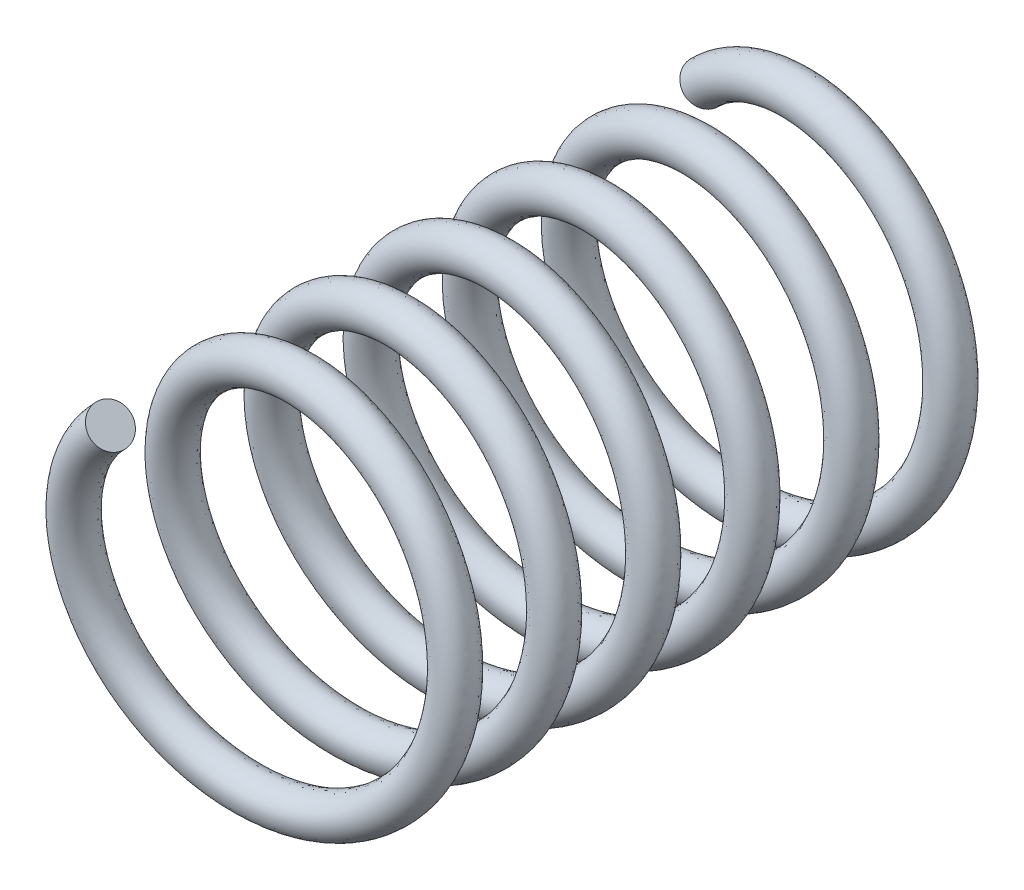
from build123d import *

# Parameters (mm, degrees)
SKETCH_4_R = 6


with BuildPart() as part:
    # Sweep 1: sweep along a curve in space
    with BuildLine() as sweep_1_path:
        add(Edge.make_bspline(
            [(-35.355339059, 35.355339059, 0), (-23.867693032, 46.842985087, 1.516666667), (-7.821723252, 49.38441703, 3.033333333), (8.224246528, 51.925848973, 4.55), (22.699524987, 44.550326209, 6.066666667), (37.174803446, 37.174803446, 7.583333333), (44.550326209, 22.699524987, 9.1), (51.925848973, 8.224246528, 10.616666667), (49.38441703, -7.821723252, 12.133333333), (46.842985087, -23.867693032, 13.65), (35.355339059, -35.355339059, 15.166666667), (23.867693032, -46.842985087, 16.683333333), (7.821723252, -49.38441703, 18.2), (-8.224246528, -51.925848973, 19.716666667), (-22.699524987, -44.550326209, 21.233333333), (-37.174803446, -37.174803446, 22.75), (-44.550326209, -22.699524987, 24.266666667), (-51.925848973, -8.224246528, 25.783333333), (-49.38441703, 7.821723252, 27.3), (-46.842985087, 23.867693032, 28.816666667), (-35.355339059, 35.355339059, 30.333333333), (-23.867693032, 46.842985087, 31.85), (-7.821723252, 49.38441703, 33.366666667), (8.224246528, 51.925848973, 34.883333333), (22.699524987, 44.550326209, 36.4), (37.174803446, 37.174803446, 37.916666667), (44.550326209, 22.699524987, 39.433333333), (51.925848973, 8.224246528, 40.95), (49.38441703, -7.821723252, 42.466666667), (46.842985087, -23.867693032, 43.983333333), (35.355339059, -35.355339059, 45.5), (23.867693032, -46.842985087, 47.016666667), (7.821723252, -49.38441703, 48.533333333), (-8.224246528, -51.925848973, 50.05), (-22.699524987, -44.550326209, 51.566666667), (-37.174803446, -37.174803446, 53.083333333), (-44.550326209, -22.699524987, 54.6), (-51.925848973, -8.224246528, 56.116666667), (-49.38441703, 7.821723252, 57.633333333), (-46.842985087, 23.867693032, 59.15), (-35.355339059, 35.355339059, 60.666666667), (-23.867693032, 46.842985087, 62.183333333), (-7.821723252, 49.38441703, 63.7), (8.224246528, 51.925848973, 65.216666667), (22.699524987, 44.550326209, 66.733333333), (37.174803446, 37.174803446, 68.25), (44.550326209, 22.699524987, 69.766666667), (51.925848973, 8.224246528, 71.283333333), (49.38441703, -7.821723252, 72.8), (46.842985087, -23.867693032, 74.316666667), (35.355339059, -35.355339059, 75.833333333), (23.867693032, -46.842985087, 77.35), (7.821723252, -49.38441703, 78.866666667), (-8.224246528, -51.925848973, 80.383333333), (-22.699524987, -44.550326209, 81.9), (-37.174803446, -37.174803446, 83.416666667), (-44.550326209, -22.699524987, 84.933333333), (-51.925848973, -8.224246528, 86.45), (-49.38441703, 7.821723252, 87.966666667), (-46.842985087, 23.867693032, 89.483333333), (-35.355339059, 35.355339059, 91), (-23.867693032, 46.842985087, 92.516666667), (-7.821723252, 49.38441703, 94.033333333), (8.224246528, 51.925848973, 95.55), (22.699524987, 44.550326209, 97.066666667), (37.174803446, 37.174803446, 98.583333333), (44.550326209, 22.699524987, 100.1), (51.925848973, 8.224246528, 101.616666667), (49.38441703, -7.821723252, 103.133333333), (46.842985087, -23.867693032, 104.65), (35.355339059, -35.355339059, 106.166666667), (23.867693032, -46.842985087, 107.683333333), (7.821723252, -49.38441703, 109.2), (-8.224246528, -51.925848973, 110.716666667), (-22.699524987, -44.550326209, 112.233333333), (-37.174803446, -37.174803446, 113.75), (-44.550326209, -22.699524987, 115.266666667), (-51.925848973, -8.224246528, 116.783333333), (-49.38441703, 7.821723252, 118.3), (-46.842985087, 23.867693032, 119.816666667), (-35.355339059, 35.355339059, 121.333333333), (-23.867693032, 46.842985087, 122.85), (-7.821723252, 49.38441703, 124.366666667), (8.224246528, 51.925848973, 125.883333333), (22.699524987, 44.550326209, 127.4), (37.174803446, 37.174803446, 128.916666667), (44.550326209, 22.699524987, 130.433333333), (51.925848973, 8.224246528, 131.95), (49.38441703, -7.821723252, 133.466666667), (46.842985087, -23.867693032, 134.983333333), (35.355339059, -35.355339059, 136.5), (23.867693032, -46.842985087, 138.016666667), (7.821723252, -49.38441703, 139.533333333), (-8.224246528, -51.925848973, 141.05), (-22.699524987, -44.550326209, 142.566666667), (-37.174803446, -37.174803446, 144.083333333), (-44.550326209, -22.699524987, 145.6), (-51.925848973, -8.224246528, 147.116666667), (-49.38441703, 7.821723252, 148.633333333), (-46.842985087, 23.867693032, 150.15), (-35.355339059, 35.355339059, 151.666666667), (-23.867693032, 46.842985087, 153.183333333), (-7.821723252, 49.38441703, 154.7), (8.224246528, 51.925848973, 156.216666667), (22.699524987, 44.550326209, 157.733333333), (37.174803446, 37.174803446, 159.25), (44.550326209, 22.699524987, 160.766666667), (51.925848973, 8.224246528, 162.283333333), (49.38441703, -7.821723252, 163.8), (46.842985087, -23.867693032, 165.316666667), (35.355339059, -35.355339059, 166.833333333), (23.867693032, -46.842985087, 168.35), (7.821723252, -49.38441703, 169.866666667), (-8.224246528, -51.925848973, 171.383333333), (-22.699524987, -44.550326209, 172.9), (-37.174803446, -37.174803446, 174.416666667), (-44.550326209, -22.699524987, 175.933333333), (-51.925848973, -8.224246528, 177.45), (-49.38441703, 7.821723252, 178.966666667), (-46.842985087, 23.867693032, 180.483333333), (-35.355339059, 35.355339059, 182)],
            knots=[0, 0, 0, 0.016666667, 0.016666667, 0.033333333, 0.033333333, 0.05, 0.05, 0.066666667, 0.066666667, 0.083333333, 0.083333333, 0.1, 0.1, 0.116666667, 0.116666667, 0.133333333, 0.133333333, 0.15, 0.15, 0.166666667, 0.166666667, 0.183333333, 0.183333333, 0.2, 0.2, 0.216666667, 0.216666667, 0.233333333, 0.233333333, 0.25, 0.25, 0.266666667, 0.266666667, 0.283333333, 0.283333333, 0.3, 0.3, 0.316666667, 0.316666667, 0.333333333, 0.333333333, 0.35, 0.35, 0.366666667, 0.366666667, 0.383333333, 0.383333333, 0.4, 0.4, 0.416666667, 0.416666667, 0.433333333, 0.433333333, 0.45, 0.45, 0.466666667, 0.466666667, 0.483333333, 0.483333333, 0.5, 0.5, 0.516666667, 0.516666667, 0.533333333, 0.533333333, 0.55, 0.55, 0.566666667, 0.566666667, 0.583333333, 0.583333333, 0.6, 0.6, 0.616666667, 0.616666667, 0.633333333, 0.633333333, 0.65, 0.65, 0.666666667, 0.666666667, 0.683333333, 0.683333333, 0.7, 0.7, 0.716666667, 0.716666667, 0.733333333, 0.733333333, 0.75, 0.75, 0.766666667, 0.766666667, 0.783333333, 0.783333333, 0.8, 0.8, 0.816666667, 0.816666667, 0.833333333, 0.833333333, 0.85, 0.85, 0.866666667, 0.866666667, 0.883333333, 0.883333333, 0.9, 0.9, 0.916666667, 0.916666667, 0.933333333, 0.933333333, 0.95, 0.95, 0.966666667, 0.966666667, 0.983333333, 0.983333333, 1, 1, 1], degree=2, weights=[1, 0.951056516, 1, 0.951056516, 1, 0.951056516, 1, 0.951056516, 1, 0.951056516, 1, 0.951056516, 1, 0.951056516, 1, 0.951056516, 1, 0.951056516, 1, 0.951056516, 1, 0.951056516, 1, 0.951056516, 1, 0.951056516, 1, 0.951056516, 1, 0.951056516, 1, 0.951056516, 1, 0.951056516, 1, 0.951056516, 1, 0.951056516, 1, 0.951056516, 1, 0.951056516, 1, 0.951056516, 1, 0.951056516, 1, 0.951056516, 1, 0.951056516, 1, 0.951056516, 1, 0.951056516, 1, 0.951056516, 1, 0.951056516, 1, 0.951056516, 1, 0.951056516, 1, 0.951056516, 1, 0.951056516, 1, 0.951056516, 1, 0.951056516, 1, 0.951056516, 1, 0.951056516, 1, 0.951056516, 1, 0.951056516, 1, 0.951056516, 1, 0.951056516, 1, 0.951056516, 1, 0.951056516, 1, 0.951056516, 1, 0.951056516, 1, 0.951056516, 1, 0.951056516, 1, 0.951056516, 1, 0.951056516, 1, 0.951056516, 1, 0.951056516, 1, 0.951056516, 1, 0.951056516, 1, 0.951056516, 1, 0.951056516, 1, 0.951056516, 1, 0.951056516, 1, 0.951056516, 1, 0.951056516, 1, 0.951056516, 1]))
    with BuildLine() as sweep_1_axis:
        Line((0, 0, 0), (0, 0, 182))
    # Sketch 4 → Sweep 1 (sweep)
    with BuildSketch(Plane(origin=(-35.355339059, 35.355339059, 182), x_dir=(-0.7101549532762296, 0.6979884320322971, 0.0921525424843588), z_dir=(0.7040454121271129, 0.704045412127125, 0.09295222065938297))):
        with Locations((0.55769126, -0.310842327)):
            Circle(SKETCH_4_R)
    sweep(path=sweep_1_path.line, binormal=sweep_1_axis.edges()[0])


solid = part.part
